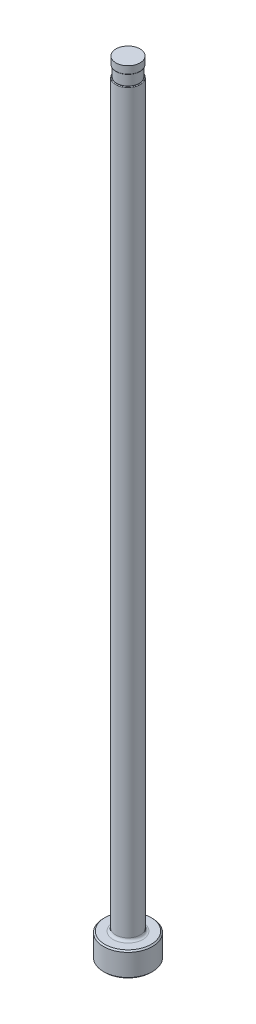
ISO-10303-21;
HEADER;
FILE_DESCRIPTION(('STEP AP214'),'2;1');
FILE_NAME('part.step','',(''),(''),'','','');
FILE_SCHEMA(('AUTOMOTIVE_DESIGN { 1 0 10303 214 1 1 1 1 }'));
ENDSEC;
DATA;
#1=APPLICATION_CONTEXT('core data for automotive mechanical design processes');
#2=APPLICATION_PROTOCOL_DEFINITION('international standard','automotive_design',2000,#1);
#3=PRODUCT_CONTEXT('',#1,'mechanical');
#4=PRODUCT('Part','Part','',(#3));
#5=PRODUCT_RELATED_PRODUCT_CATEGORY('part','',(#4));
#6=PRODUCT_DEFINITION_FORMATION('','',#4);
#7=PRODUCT_DEFINITION_CONTEXT('part definition',#1,'design');
#8=PRODUCT_DEFINITION('design','',#6,#7);
#9=PRODUCT_DEFINITION_SHAPE('','',#8);
#10=(LENGTH_UNIT() NAMED_UNIT(*) SI_UNIT(.MILLI.,.METRE.));
#11=(NAMED_UNIT(*) PLANE_ANGLE_UNIT() SI_UNIT($,.RADIAN.));
#12=(NAMED_UNIT(*) SI_UNIT($,.STERADIAN.) SOLID_ANGLE_UNIT());
#13=UNCERTAINTY_MEASURE_WITH_UNIT(LENGTH_MEASURE(1.E-05),#10,'distance_accuracy_value','');
#14=(GEOMETRIC_REPRESENTATION_CONTEXT(3) GLOBAL_UNCERTAINTY_ASSIGNED_CONTEXT((#13)) GLOBAL_UNIT_ASSIGNED_CONTEXT((#10,
#11,#12)) REPRESENTATION_CONTEXT('',''));
#15=CARTESIAN_POINT('',(0.,0.,0.));
#16=DIRECTION('',(0.,0.,1.));
#17=DIRECTION('',(1.,0.,0.));
#18=AXIS2_PLACEMENT_3D('',#15,#16,#17);
#19=CARTESIAN_POINT('',(-2.38124999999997,150.876,0.));
#20=DIRECTION('',(0.,1.,0.));
#21=DIRECTION('',(0.,0.,1.));
#22=AXIS2_PLACEMENT_3D('',#19,#20,#21);
#23=PLANE('',#22);
#24=CARTESIAN_POINT('',(0.,150.876,0.));
#25=DIRECTION('',(0.,1.,0.));
#26=DIRECTION('',(0.,0.,1.));
#27=AXIS2_PLACEMENT_3D('',#24,#25,#26);
#28=CIRCLE('',#27,2.22884999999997);
#29=CARTESIAN_POINT('',(0.,150.876,2.22884999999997));
#30=VERTEX_POINT('',#29);
#31=EDGE_CURVE('E11',#30,#30,#28,.F.);
#32=ORIENTED_EDGE('',*,*,#31,.T.);
#33=EDGE_LOOP('',(#32));
#34=FACE_BOUND('',#33,.T.);
#35=CARTESIAN_POINT('',(0.,150.876,0.));
#36=DIRECTION('',(0.,1.,0.));
#37=DIRECTION('',(0.,0.,1.));
#38=AXIS2_PLACEMENT_3D('',#35,#36,#37);
#39=CIRCLE('',#38,2.17804999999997);
#40=CARTESIAN_POINT('',(0.,150.876,2.17804999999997));
#41=VERTEX_POINT('',#40);
#42=EDGE_CURVE('E78',#41,#41,#39,.T.);
#43=ORIENTED_EDGE('',*,*,#42,.T.);
#44=EDGE_LOOP('',(#43));
#45=FACE_BOUND('',#44,.T.);
#46=ADVANCED_FACE('F36',(#34,#45),#23,.F.);
#47=CARTESIAN_POINT('',(0.,259.958771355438,0.));
#48=DIRECTION('',(0.,1.,0.));
#49=DIRECTION('',(0.,0.,1.));
#50=AXIS2_PLACEMENT_3D('',#47,#48,#49);
#51=CYLINDRICAL_SURFACE('',#50,2.38124999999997);
#52=DIRECTION('',(0.,1.,0.));
#53=VECTOR('',#52,1.);
#54=CARTESIAN_POINT('',(-2.17804999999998,259.958771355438,-0.962522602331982));
#55=LINE('',#54,#53);
#56=CARTESIAN_POINT('',(-2.17804999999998,148.717,-0.962522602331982));
#57=VERTEX_POINT('',#56);
#58=CARTESIAN_POINT('',(-2.17804999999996,86.36,-0.962522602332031));
#59=VERTEX_POINT('',#58);
#60=EDGE_CURVE('E73',#57,#59,#55,.F.);
#61=ORIENTED_EDGE('',*,*,#60,.F.);
#62=CARTESIAN_POINT('',(0.,148.717,0.));
#63=DIRECTION('',(0.,-1.,0.));
#64=DIRECTION('',(0.,0.,-1.));
#65=AXIS2_PLACEMENT_3D('',#62,#63,#64);
#66=CIRCLE('',#65,2.38124999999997);
#67=CARTESIAN_POINT('',(-2.17804999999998,148.717,0.962522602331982));
#68=VERTEX_POINT('',#67);
#69=EDGE_CURVE('E51',#57,#68,#66,.T.);
#70=ORIENTED_EDGE('',*,*,#69,.T.);
#71=DIRECTION('',(0.,1.,0.));
#72=VECTOR('',#71,1.);
#73=CARTESIAN_POINT('',(-2.17804999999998,259.958771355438,0.962522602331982));
#74=LINE('',#73,#72);
#75=CARTESIAN_POINT('',(-2.17804999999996,86.36,0.96252260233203));
#76=VERTEX_POINT('',#75);
#77=EDGE_CURVE('E84',#76,#68,#74,.T.);
#78=ORIENTED_EDGE('',*,*,#77,.F.);
#79=CARTESIAN_POINT('',(-2.17804999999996,86.36,-0.96252260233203));
#80=CARTESIAN_POINT('',(-2.17804780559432,86.3255018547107,-0.962518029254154));
#81=CARTESIAN_POINT('',(-2.17861298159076,86.291018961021,-0.96124991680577));
#82=CARTESIAN_POINT('',(-2.18085247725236,86.2222686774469,-0.956161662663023));
#83=CARTESIAN_POINT('',(-2.18252711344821,86.1880013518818,-0.952340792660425));
#84=CARTESIAN_POINT('',(-2.1891933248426,86.0855683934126,-0.936973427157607));
#85=CARTESIAN_POINT('',(-2.19582685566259,86.0180398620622,-0.921521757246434));
#86=CARTESIAN_POINT('',(-2.21282724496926,85.8866839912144,-0.879915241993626));
#87=CARTESIAN_POINT('',(-2.22320261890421,85.8228654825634,-0.853735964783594));
#88=CARTESIAN_POINT('',(-2.24648169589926,85.701467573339,-0.79044419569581));
#89=CARTESIAN_POINT('',(-2.25938069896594,85.6438768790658,-0.753351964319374));
#90=CARTESIAN_POINT('',(-2.28491232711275,85.5416356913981,-0.671716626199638));
#91=CARTESIAN_POINT('',(-2.29748627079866,85.4963240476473,-0.627987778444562));
#92=CARTESIAN_POINT('',(-2.32155764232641,85.4152931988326,-0.53211549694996));
#93=CARTESIAN_POINT('',(-2.33305607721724,85.3795649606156,-0.479980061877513));
#94=CARTESIAN_POINT('',(-2.35169958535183,85.3240195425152,-0.377071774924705));
#95=CARTESIAN_POINT('',(-2.35923505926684,85.3026414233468,-0.327210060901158));
#96=CARTESIAN_POINT('',(-2.37124673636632,85.2692228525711,-0.224104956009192));
#97=CARTESIAN_POINT('',(-2.37572523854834,85.2571753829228,-0.170864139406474));
#98=CARTESIAN_POINT('',(-2.38075337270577,85.2437017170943,-0.0686114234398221));
#99=CARTESIAN_POINT('',(-2.38166713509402,85.2412904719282,-0.01974474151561));
#100=CARTESIAN_POINT('',(-2.38048039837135,85.2444469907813,0.0776854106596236));
#101=CARTESIAN_POINT('',(-2.37838078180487,85.2500124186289,0.126248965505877));
#102=CARTESIAN_POINT('',(-2.37150634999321,85.2686178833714,0.220133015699));
#103=CARTESIAN_POINT('',(-2.36681675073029,85.2814201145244,0.265507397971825));
#104=CARTESIAN_POINT('',(-2.35529269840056,85.3138782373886,0.353434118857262));
#105=CARTESIAN_POINT('',(-2.34845810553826,85.3335345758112,0.395986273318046));
#106=CARTESIAN_POINT('',(-2.33302551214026,85.3798518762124,0.47872487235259));
#107=CARTESIAN_POINT('',(-2.32437464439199,85.4067318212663,0.518778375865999));
#108=CARTESIAN_POINT('',(-2.30627307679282,85.466276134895,0.594104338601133));
#109=CARTESIAN_POINT('',(-2.29682214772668,85.4989421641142,0.629375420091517));
#110=CARTESIAN_POINT('',(-2.2770553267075,85.572313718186,0.697674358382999));
#111=CARTESIAN_POINT('',(-2.26673904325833,85.6134804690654,0.730205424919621));
#112=CARTESIAN_POINT('',(-2.24701006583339,85.7003579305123,0.788832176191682));
#113=CARTESIAN_POINT('',(-2.23759789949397,85.7460712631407,0.81492411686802));
#114=CARTESIAN_POINT('',(-2.2192874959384,85.8470502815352,0.863643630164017));
#115=CARTESIAN_POINT('',(-2.21061480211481,85.9027854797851,0.885381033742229));
#116=CARTESIAN_POINT('',(-2.1960946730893,86.0171026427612,0.92080773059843));
#117=CARTESIAN_POINT('',(-2.19024759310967,86.0756849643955,0.93449601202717));
#118=CARTESIAN_POINT('',(-2.18339215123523,86.1721545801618,0.950364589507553));
#119=CARTESIAN_POINT('',(-2.18139223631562,86.2096004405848,0.954933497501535));
#120=CARTESIAN_POINT('',(-2.17872026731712,86.2846947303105,0.961006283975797));
#121=CARTESIAN_POINT('',(-2.1780449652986,86.3223424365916,0.962517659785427));
#122=CARTESIAN_POINT('',(-2.17804999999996,86.36,0.96252260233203));
#123=B_SPLINE_CURVE_WITH_KNOTS('',3,(#79,#80,#81,#82,#83,#84,#85,#86,#87,#88,#89,#90,#91,#92,
#93,#94,#95,#96,#97,#98,#99,#100,#101,#102,#103,#104,#105,#106,#107,#108,#109,#110,#111,#112,
#113,#114,#115,#116,#117,#118,#119,#120,#121,#122),.UNSPECIFIED.,.F.,.F.,(4,2,2,2,2,2,2,2,2,2,2,
2,2,2,2,2,2,2,2,2,2,4),(0.,0.103435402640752,0.206900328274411,0.414624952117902,
0.622825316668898,0.830641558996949,1.02213180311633,1.21344091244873,1.37683606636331,
1.54010820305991,1.68618349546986,1.83221601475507,1.97370762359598,2.11520845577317,
2.26160909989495,2.40805183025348,2.56783060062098,2.72770205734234,2.90833881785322,
3.08899828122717,3.2021919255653,3.31510767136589),.UNSPECIFIED.);
#124=EDGE_CURVE('E81',#59,#76,#123,.T.);
#125=ORIENTED_EDGE('',*,*,#124,.F.);
#126=EDGE_LOOP('',(#61,#70,#78,#125));
#127=FACE_BOUND('',#126,.T.);
#128=CARTESIAN_POINT('',(0.,5.25779999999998,0.));
#129=DIRECTION('',(0.,1.,0.));
#130=DIRECTION('',(0.,0.,1.));
#131=AXIS2_PLACEMENT_3D('',#128,#129,#130);
#132=CIRCLE('',#131,2.38124999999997);
#133=CARTESIAN_POINT('',(0.,5.25779999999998,2.38124999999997));
#134=VERTEX_POINT('',#133);
#135=EDGE_CURVE('E116',#134,#134,#132,.T.);
#136=ORIENTED_EDGE('',*,*,#135,.T.);
#137=EDGE_LOOP('',(#136));
#138=FACE_BOUND('',#137,.T.);
#139=ADVANCED_FACE('F82',(#127,#138),#51,.T.);
#140=CARTESIAN_POINT('',(0.,0.,0.));
#141=DIRECTION('',(0.,-1.,0.));
#142=DIRECTION('',(0.,0.,-1.));
#143=AXIS2_PLACEMENT_3D('',#140,#141,#142);
#144=PLANE('',#143);
#145=CARTESIAN_POINT('',(0.,0.,0.));
#146=DIRECTION('',(0.,-1.,0.));
#147=DIRECTION('',(0.,0.,-1.));
#148=AXIS2_PLACEMENT_3D('',#145,#146,#147);
#149=CIRCLE('',#148,4.50849999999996);
#150=CARTESIAN_POINT('',(0.,0.,-4.50849999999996));
#151=VERTEX_POINT('',#150);
#152=EDGE_CURVE('E113',#151,#151,#149,.T.);
#153=ORIENTED_EDGE('',*,*,#152,.T.);
#154=EDGE_LOOP('',(#153));
#155=FACE_BOUND('',#154,.T.);
#156=ADVANCED_FACE('F192',(#155),#144,.T.);
#157=CARTESIAN_POINT('',(0.,259.958771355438,0.));
#158=DIRECTION('',(0.,1.,0.));
#159=DIRECTION('',(0.,0.,1.));
#160=AXIS2_PLACEMENT_3D('',#157,#158,#159);
#161=CYLINDRICAL_SURFACE('',#160,4.76249999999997);
#162=CARTESIAN_POINT('',(0.,4.49579999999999,0.));
#163=DIRECTION('',(0.,1.,0.));
#164=DIRECTION('',(0.,0.,1.));
#165=AXIS2_PLACEMENT_3D('',#162,#163,#164);
#166=CIRCLE('',#165,4.76249999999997);
#167=CARTESIAN_POINT('',(0.,4.49579999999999,4.76249999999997));
#168=VERTEX_POINT('',#167);
#169=EDGE_CURVE('E110',#168,#168,#166,.F.);
#170=ORIENTED_EDGE('',*,*,#169,.T.);
#171=EDGE_LOOP('',(#170));
#172=FACE_BOUND('',#171,.T.);
#173=CARTESIAN_POINT('',(0.,0.254000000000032,0.));
#174=DIRECTION('',(0.,-1.,0.));
#175=DIRECTION('',(0.,0.,-1.));
#176=AXIS2_PLACEMENT_3D('',#173,#174,#175);
#177=CIRCLE('',#176,4.76249999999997);
#178=CARTESIAN_POINT('',(0.,0.254000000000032,-4.76249999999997));
#179=VERTEX_POINT('',#178);
#180=EDGE_CURVE('E107',#179,#179,#177,.F.);
#181=ORIENTED_EDGE('',*,*,#180,.T.);
#182=EDGE_LOOP('',(#181));
#183=FACE_BOUND('',#182,.T.);
#184=ADVANCED_FACE('F195',(#172,#183),#161,.T.);
#185=CARTESIAN_POINT('',(-4.76249999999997,4.7498,0.));
#186=DIRECTION('',(0.,1.,0.));
#187=DIRECTION('',(0.,0.,1.));
#188=AXIS2_PLACEMENT_3D('',#185,#186,#187);
#189=PLANE('',#188);
#190=CARTESIAN_POINT('',(0.,4.7498,0.));
#191=DIRECTION('',(0.,1.,0.));
#192=DIRECTION('',(0.,0.,1.));
#193=AXIS2_PLACEMENT_3D('',#190,#191,#192);
#194=CIRCLE('',#193,2.88924999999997);
#195=CARTESIAN_POINT('',(0.,4.7498,2.88924999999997));
#196=VERTEX_POINT('',#195);
#197=EDGE_CURVE('E87',#196,#196,#194,.F.);
#198=ORIENTED_EDGE('',*,*,#197,.T.);
#199=EDGE_LOOP('',(#198));
#200=FACE_BOUND('',#199,.T.);
#201=CARTESIAN_POINT('',(0.,4.7498,0.));
#202=DIRECTION('',(0.,1.,0.));
#203=DIRECTION('',(0.,0.,1.));
#204=AXIS2_PLACEMENT_3D('',#201,#202,#203);
#205=CIRCLE('',#204,4.50849999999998);
#206=CARTESIAN_POINT('',(0.,4.7498,4.50849999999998));
#207=VERTEX_POINT('',#206);
#208=EDGE_CURVE('E104',#207,#207,#205,.T.);
#209=ORIENTED_EDGE('',*,*,#208,.T.);
#210=EDGE_LOOP('',(#209));
#211=FACE_BOUND('',#210,.T.);
#212=ADVANCED_FACE('F190',(#200,#211),#189,.T.);
#213=CARTESIAN_POINT('',(0.,4.74980000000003,0.));
#214=DIRECTION('',(0.,-1.,0.));
#215=DIRECTION('',(0.,0.,-1.));
#216=AXIS2_PLACEMENT_3D('',#213,#214,#215);
#217=CONICAL_SURFACE('',#216,4.50849999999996,0.785398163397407);
#218=ORIENTED_EDGE('',*,*,#169,.F.);
#219=EDGE_LOOP('',(#218));
#220=FACE_BOUND('',#219,.T.);
#221=ORIENTED_EDGE('',*,*,#208,.F.);
#222=EDGE_LOOP('',(#221));
#223=FACE_BOUND('',#222,.T.);
#224=ADVANCED_FACE('F186',(#220,#223),#217,.T.);
#225=CARTESIAN_POINT('',(0.,0.254000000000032,0.));
#226=DIRECTION('',(0.,1.,0.));
#227=DIRECTION('',(0.,0.,1.));
#228=AXIS2_PLACEMENT_3D('',#225,#226,#227);
#229=CONICAL_SURFACE('',#228,4.76249999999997,0.785398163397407);
#230=ORIENTED_EDGE('',*,*,#152,.F.);
#231=EDGE_LOOP('',(#230));
#232=FACE_BOUND('',#231,.T.);
#233=ORIENTED_EDGE('',*,*,#180,.F.);
#234=EDGE_LOOP('',(#233));
#235=FACE_BOUND('',#234,.T.);
#236=ADVANCED_FACE('F182',(#232,#235),#229,.T.);
#237=CARTESIAN_POINT('',(0.,5.25779999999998,0.));
#238=DIRECTION('',(0.,1.,0.));
#239=DIRECTION('',(0.,0.,1.));
#240=AXIS2_PLACEMENT_3D('',#237,#238,#239);
#241=TOROIDAL_SURFACE('',#240,2.88924999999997,0.508);
#242=ORIENTED_EDGE('',*,*,#197,.F.);
#243=EDGE_LOOP('',(#242));
#244=FACE_BOUND('',#243,.T.);
#245=ORIENTED_EDGE('',*,*,#135,.F.);
#246=EDGE_LOOP('',(#245));
#247=FACE_BOUND('',#246,.T.);
#248=ADVANCED_FACE('F147',(#244,#247),#241,.F.);
#249=CARTESIAN_POINT('',(-2.38124999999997,148.844,0.));
#250=DIRECTION('',(0.,-1.,0.));
#251=DIRECTION('',(0.,0.,-1.));
#252=AXIS2_PLACEMENT_3D('',#249,#250,#251);
#253=PLANE('',#252);
#254=DIRECTION('',(0.,0.,1.));
#255=VECTOR('',#254,1.);
#256=CARTESIAN_POINT('',(-2.17804999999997,148.844,0.));
#257=LINE('',#256,#255);
#258=CARTESIAN_POINT('',(-2.17804999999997,148.844,0.));
#259=VERTEX_POINT('',#258);
#260=CARTESIAN_POINT('',(-2.17804999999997,148.844,0.581155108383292));
#261=VERTEX_POINT('',#260);
#262=EDGE_CURVE('E90',#259,#261,#257,.T.);
#263=ORIENTED_EDGE('',*,*,#262,.T.);
#264=CARTESIAN_POINT('',(0.,148.844,0.));
#265=DIRECTION('',(0.,-1.,0.));
#266=DIRECTION('',(0.,0.,-1.));
#267=AXIS2_PLACEMENT_3D('',#264,#265,#266);
#268=CIRCLE('',#267,2.25424999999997);
#269=CARTESIAN_POINT('',(-2.17804999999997,148.844,-0.581155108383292));
#270=VERTEX_POINT('',#269);
#271=EDGE_CURVE('E86',#261,#270,#268,.F.);
#272=ORIENTED_EDGE('',*,*,#271,.T.);
#273=EDGE_CURVE('E79',#270,#259,#257,.T.);
#274=ORIENTED_EDGE('',*,*,#273,.T.);
#275=CARTESIAN_POINT('',(0.,148.844,0.));
#276=DIRECTION('',(0.,1.,0.));
#277=DIRECTION('',(0.,0.,1.));
#278=AXIS2_PLACEMENT_3D('',#275,#276,#277);
#279=CIRCLE('',#278,2.17804999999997);
#280=EDGE_CURVE('E101',#259,#259,#279,.T.);
#281=ORIENTED_EDGE('',*,*,#280,.F.);
#282=EDGE_LOOP('',(#263,#272,#274,#281));
#283=FACE_BOUND('',#282,.T.);
#284=ADVANCED_FACE('F144',(#283),#253,.F.);
#285=CARTESIAN_POINT('',(0.,153.448281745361,0.));
#286=DIRECTION('',(0.,1.,0.));
#287=DIRECTION('',(0.,0.,1.));
#288=AXIS2_PLACEMENT_3D('',#285,#286,#287);
#289=CYLINDRICAL_SURFACE('',#288,2.17804999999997);
#290=ORIENTED_EDGE('',*,*,#42,.F.);
#291=EDGE_LOOP('',(#290));
#292=FACE_BOUND('',#291,.T.);
#293=ORIENTED_EDGE('',*,*,#280,.T.);
#294=EDGE_LOOP('',(#293));
#295=FACE_BOUND('',#294,.T.);
#296=ADVANCED_FACE('F141',(#292,#295),#289,.T.);
#297=CARTESIAN_POINT('',(-2.17804999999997,149.86,-4.76249999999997));
#298=DIRECTION('',(1.,0.,0.));
#299=DIRECTION('',(0.,1.,0.));
#300=AXIS2_PLACEMENT_3D('',#297,#298,#299);
#301=PLANE('',#300);
#302=ORIENTED_EDGE('',*,*,#273,.F.);
#303=CARTESIAN_POINT('',(-2.17804999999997,148.844,-0.581155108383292));
#304=CARTESIAN_POINT('',(-2.17804999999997,148.843983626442,-0.602476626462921));
#305=CARTESIAN_POINT('',(-2.17804999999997,148.843640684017,-0.623812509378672));
#306=CARTESIAN_POINT('',(-2.17804999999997,148.841977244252,-0.666576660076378));
#307=CARTESIAN_POINT('',(-2.17804999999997,148.840650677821,-0.688004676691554));
#308=CARTESIAN_POINT('',(-2.17804999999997,148.836700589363,-0.730611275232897));
#309=CARTESIAN_POINT('',(-2.17804999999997,148.834085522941,-0.751790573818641));
#310=CARTESIAN_POINT('',(-2.17804999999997,148.827057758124,-0.793813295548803));
#311=CARTESIAN_POINT('',(-2.17804999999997,148.82264941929,-0.814657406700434));
#312=CARTESIAN_POINT('',(-2.17804999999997,148.812237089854,-0.851716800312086));
#313=CARTESIAN_POINT('',(-2.17804999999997,148.806702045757,-0.868052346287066));
#314=CARTESIAN_POINT('',(-2.17804999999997,148.795132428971,-0.894514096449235));
#315=CARTESIAN_POINT('',(-2.17804999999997,148.789824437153,-0.9049545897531));
#316=CARTESIAN_POINT('',(-2.17804999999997,148.777415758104,-0.92469921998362));
#317=CARTESIAN_POINT('',(-2.17804999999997,148.77033515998,-0.934014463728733));
#318=CARTESIAN_POINT('',(-2.17804999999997,148.759229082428,-0.944592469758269));
#319=CARTESIAN_POINT('',(-2.17804999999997,148.756360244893,-0.947051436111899));
#320=CARTESIAN_POINT('',(-2.17804999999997,148.750314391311,-0.951571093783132));
#321=CARTESIAN_POINT('',(-2.17804999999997,148.747137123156,-0.953631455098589));
#322=CARTESIAN_POINT('',(-2.17804999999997,148.740434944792,-0.957234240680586));
#323=CARTESIAN_POINT('',(-2.17804999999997,148.736905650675,-0.958768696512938));
#324=CARTESIAN_POINT('',(-2.17804999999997,148.729614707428,-0.961099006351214));
#325=CARTESIAN_POINT('',(-2.17804999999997,148.725854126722,-0.961898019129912));
#326=CARTESIAN_POINT('',(-2.17804999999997,148.721218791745,-0.962356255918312));
#327=CARTESIAN_POINT('',(-2.17804999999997,148.720376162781,-0.962418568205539));
#328=CARTESIAN_POINT('',(-2.17804999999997,148.718689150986,-0.962501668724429));
#329=CARTESIAN_POINT('',(-2.17804999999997,148.717844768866,-0.962522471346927));
#330=CARTESIAN_POINT('',(-2.17804999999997,148.717,-0.962522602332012));
#331=B_SPLINE_CURVE_WITH_KNOTS('',3,(#303,#304,#305,#306,#307,#308,#309,#310,#311,#312,#313,
#314,#315,#316,#317,#318,#319,#320,#321,#322,#323,#324,#325,#326,#327,#328,#329,#330),
.UNSPECIFIED.,.F.,.F.,(4,2,2,2,2,2,2,2,2,2,2,2,2,4),(0.,0.063984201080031,0.128366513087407,
0.192331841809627,0.256142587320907,0.307700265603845,0.342760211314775,0.377439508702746,
0.388748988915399,0.400067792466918,0.411551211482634,0.422985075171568,0.4255192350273,
0.42805251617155),.UNSPECIFIED.);
#332=EDGE_CURVE('E59',#270,#57,#331,.T.);
#333=ORIENTED_EDGE('',*,*,#332,.T.);
#334=ORIENTED_EDGE('',*,*,#60,.T.);
#335=DIRECTION('',(0.,0.,1.));
#336=VECTOR('',#335,1.);
#337=CARTESIAN_POINT('',(-2.17804999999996,86.36,-4.76249999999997));
#338=LINE('',#337,#336);
#339=EDGE_CURVE('E77',#59,#76,#338,.T.);
#340=ORIENTED_EDGE('',*,*,#339,.T.);
#341=ORIENTED_EDGE('',*,*,#77,.T.);
#342=CARTESIAN_POINT('',(-2.17804999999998,148.717,0.962522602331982));
#343=CARTESIAN_POINT('',(-2.17804999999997,148.720186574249,0.962531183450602));
#344=CARTESIAN_POINT('',(-2.17804999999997,148.723361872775,0.9622263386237));
#345=CARTESIAN_POINT('',(-2.17804999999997,148.729573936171,0.961069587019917));
#346=CARTESIAN_POINT('',(-2.17804999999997,148.732611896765,0.960224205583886));
#347=CARTESIAN_POINT('',(-2.17804999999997,148.739208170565,0.957808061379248));
#348=CARTESIAN_POINT('',(-2.17804999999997,148.742720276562,0.956113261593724));
#349=CARTESIAN_POINT('',(-2.17804999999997,148.749436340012,0.952177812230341));
#350=CARTESIAN_POINT('',(-2.17804999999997,148.752638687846,0.949934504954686));
#351=CARTESIAN_POINT('',(-2.17804999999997,148.760556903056,0.943588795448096));
#352=CARTESIAN_POINT('',(-2.17804999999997,148.765024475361,0.93917980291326));
#353=CARTESIAN_POINT('',(-2.17804999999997,148.773265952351,0.929766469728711));
#354=CARTESIAN_POINT('',(-2.17804999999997,148.777038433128,0.924760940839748));
#355=CARTESIAN_POINT('',(-2.17804999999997,148.787602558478,0.909080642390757));
#356=CARTESIAN_POINT('',(-2.17804999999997,148.793541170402,0.897838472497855));
#357=CARTESIAN_POINT('',(-2.17804999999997,148.803910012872,0.87469166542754));
#358=CARTESIAN_POINT('',(-2.17804999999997,148.808335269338,0.862784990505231));
#359=CARTESIAN_POINT('',(-2.17804999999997,148.818383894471,0.831512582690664));
#360=CARTESIAN_POINT('',(-2.17804999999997,148.823178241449,0.811883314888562));
#361=CARTESIAN_POINT('',(-2.17804999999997,148.83096264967,0.772260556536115));
#362=CARTESIAN_POINT('',(-2.17804999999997,148.83394845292,0.752266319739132));
#363=CARTESIAN_POINT('',(-2.17804999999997,148.840978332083,0.691996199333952));
#364=CARTESIAN_POINT('',(-2.17804999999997,148.843079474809,0.651494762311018));
#365=CARTESIAN_POINT('',(-2.17804999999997,148.843838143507,0.606044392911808));
#366=CARTESIAN_POINT('',(-2.17804999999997,148.843899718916,0.601059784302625));
#367=CARTESIAN_POINT('',(-2.17804999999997,148.843980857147,0.591102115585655));
#368=CARTESIAN_POINT('',(-2.17804999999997,148.844000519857,0.586129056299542));
#369=CARTESIAN_POINT('',(-2.17804999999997,148.844,0.581155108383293));
#370=B_SPLINE_CURVE_WITH_KNOTS('',3,(#342,#343,#344,#345,#346,#347,#348,#349,#350,#351,#352,
#353,#354,#355,#356,#357,#358,#359,#360,#361,#362,#363,#364,#365,#366,#367,#368,#369),
.UNSPECIFIED.,.F.,.F.,(4,2,2,2,2,2,2,2,2,2,2,2,2,4),(0.,0.00952696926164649,0.0189410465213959,
0.0305748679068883,0.0422662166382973,0.060990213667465,0.0797521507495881,0.117682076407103,
0.155735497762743,0.216197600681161,0.27680150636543,0.39819894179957,0.413154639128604,
0.428074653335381),.UNSPECIFIED.);
#371=EDGE_CURVE('E172',#68,#261,#370,.T.);
#372=ORIENTED_EDGE('',*,*,#371,.T.);
#373=ORIENTED_EDGE('',*,*,#262,.F.);
#374=EDGE_LOOP('',(#302,#333,#334,#340,#341,#372,#373));
#375=FACE_BOUND('',#374,.T.);
#376=ADVANCED_FACE('F75',(#375),#301,.F.);
#377=CARTESIAN_POINT('',(-5.35304999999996,86.36,-4.76249999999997));
#378=DIRECTION('',(0.,0.,1.));
#379=DIRECTION('',(1.,0.,0.));
#380=AXIS2_PLACEMENT_3D('',#377,#378,#379);
#381=CYLINDRICAL_SURFACE('',#380,3.175);
#382=ORIENTED_EDGE('',*,*,#339,.F.);
#383=ORIENTED_EDGE('',*,*,#124,.T.);
#384=EDGE_LOOP('',(#382,#383));
#385=FACE_BOUND('',#384,.T.);
#386=ADVANCED_FACE('F89',(#385),#381,.F.);
#387=CARTESIAN_POINT('',(0.,152.687735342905,0.));
#388=DIRECTION('',(0.,1.,0.));
#389=DIRECTION('',(0.,0.,1.));
#390=AXIS2_PLACEMENT_3D('',#387,#388,#389);
#391=CYLINDRICAL_SURFACE('',#390,2.35584999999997);
#392=CARTESIAN_POINT('',(0.,151.003,0.));
#393=DIRECTION('',(0.,1.,0.));
#394=DIRECTION('',(0.,0.,1.));
#395=AXIS2_PLACEMENT_3D('',#392,#393,#394);
#396=CIRCLE('',#395,2.35584999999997);
#397=CARTESIAN_POINT('',(0.,151.003,2.35584999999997));
#398=VERTEX_POINT('',#397);
#399=EDGE_CURVE('E44',#398,#398,#396,.T.);
#400=ORIENTED_EDGE('',*,*,#399,.T.);
#401=EDGE_LOOP('',(#400));
#402=FACE_BOUND('',#401,.T.);
#403=CARTESIAN_POINT('',(0.,152.4,0.));
#404=DIRECTION('',(0.,1.,0.));
#405=DIRECTION('',(0.,0.,1.));
#406=AXIS2_PLACEMENT_3D('',#403,#404,#405);
#407=CIRCLE('',#406,2.35584999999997);
#408=CARTESIAN_POINT('',(0.,152.4,2.35584999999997));
#409=VERTEX_POINT('',#408);
#410=EDGE_CURVE('E91',#409,#409,#407,.T.);
#411=ORIENTED_EDGE('',*,*,#410,.F.);
#412=EDGE_LOOP('',(#411));
#413=FACE_BOUND('',#412,.T.);
#414=ADVANCED_FACE('F135',(#402,#413),#391,.T.);
#415=CARTESIAN_POINT('',(-2.38124999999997,152.4,0.));
#416=DIRECTION('',(0.,1.,0.));
#417=DIRECTION('',(0.,0.,1.));
#418=AXIS2_PLACEMENT_3D('',#415,#416,#417);
#419=PLANE('',#418);
#420=ORIENTED_EDGE('',*,*,#410,.T.);
#421=EDGE_LOOP('',(#420));
#422=FACE_BOUND('',#421,.T.);
#423=ADVANCED_FACE('F149',(#422),#419,.T.);
#424=CARTESIAN_POINT('',(0.,148.717,0.));
#425=DIRECTION('',(0.,-1.,0.));
#426=DIRECTION('',(0.,0.,-1.));
#427=AXIS2_PLACEMENT_3D('',#424,#425,#426);
#428=TOROIDAL_SURFACE('',#427,2.25424999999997,0.127);
#429=ORIENTED_EDGE('',*,*,#371,.F.);
#430=ORIENTED_EDGE('',*,*,#69,.F.);
#431=ORIENTED_EDGE('',*,*,#332,.F.);
#432=ORIENTED_EDGE('',*,*,#271,.F.);
#433=EDGE_LOOP('',(#429,#430,#431,#432));
#434=FACE_BOUND('',#433,.T.);
#435=ADVANCED_FACE('F151',(#434),#428,.T.);
#436=CARTESIAN_POINT('',(0.,151.003,0.));
#437=DIRECTION('',(0.,1.,0.));
#438=DIRECTION('',(0.,0.,1.));
#439=AXIS2_PLACEMENT_3D('',#436,#437,#438);
#440=TOROIDAL_SURFACE('',#439,2.22884999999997,0.127);
#441=ORIENTED_EDGE('',*,*,#31,.F.);
#442=EDGE_LOOP('',(#441));
#443=FACE_BOUND('',#442,.T.);
#444=ORIENTED_EDGE('',*,*,#399,.F.);
#445=EDGE_LOOP('',(#444));
#446=FACE_BOUND('',#445,.T.);
#447=ADVANCED_FACE('F38',(#443,#446),#440,.T.);
#448=CLOSED_SHELL('',(#46,#139,#156,#184,#212,#224,#236,#248,#284,#296,#376,#386,#414,#423,#435,#447));
#449=MANIFOLD_SOLID_BREP('B2',#448);
#450=ADVANCED_BREP_SHAPE_REPRESENTATION('',(#18,#449),#14);
#451=SHAPE_DEFINITION_REPRESENTATION(#9,#450);
ENDSEC;
END-ISO-10303-21;
